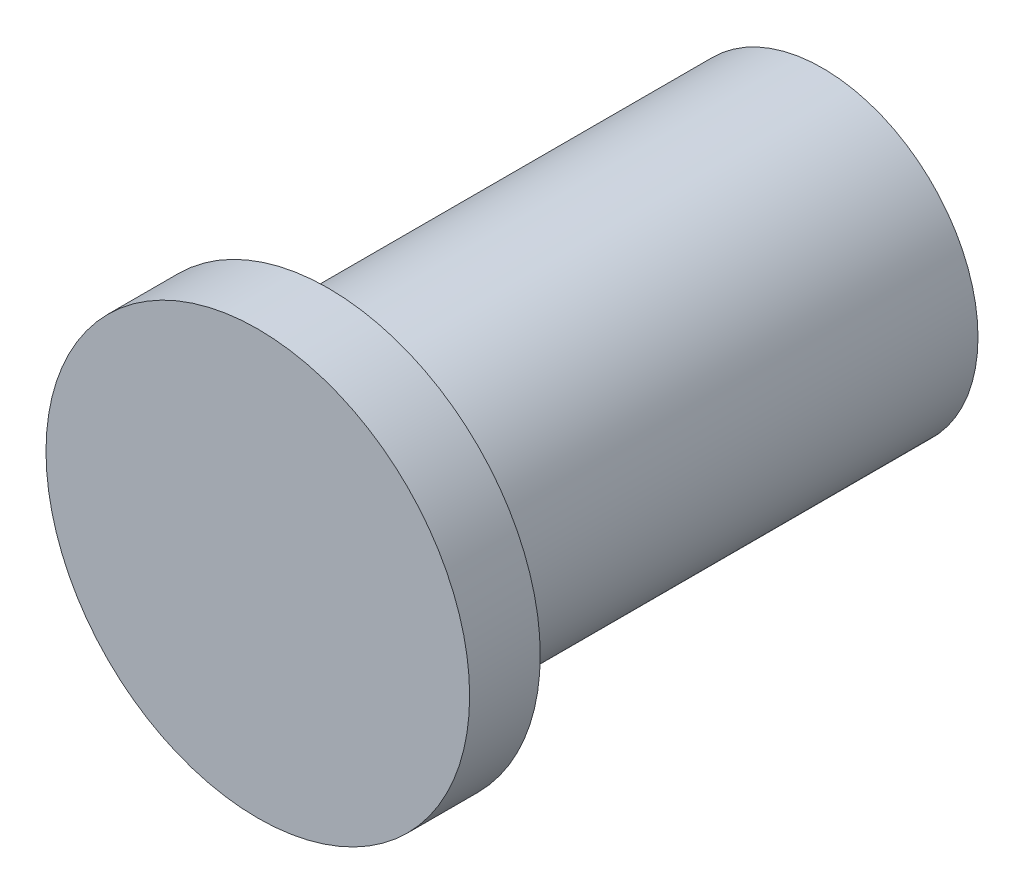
from build123d import *

# Parameters (mm, degrees)
SKETCH1_R           = 13.97
BOSS_EXTRUDE1_DEPTH = 44.45
SKETCH2_R           = 19.05
BOSS_EXTRUDE2_DEPTH = 6.35


with BuildPart() as part:
    # Sketch1 → Boss-Extrude1 (new body)
    with BuildSketch(Plane.XY):
        Circle(SKETCH1_R)
    extrude(amount=BOSS_EXTRUDE1_DEPTH)

    # Sketch2 → Boss-Extrude2 (add)
    with BuildSketch(Plane.XY.offset(44.45)):
        Circle(SKETCH2_R)
    extrude(amount=BOSS_EXTRUDE2_DEPTH)


solid = part.part
